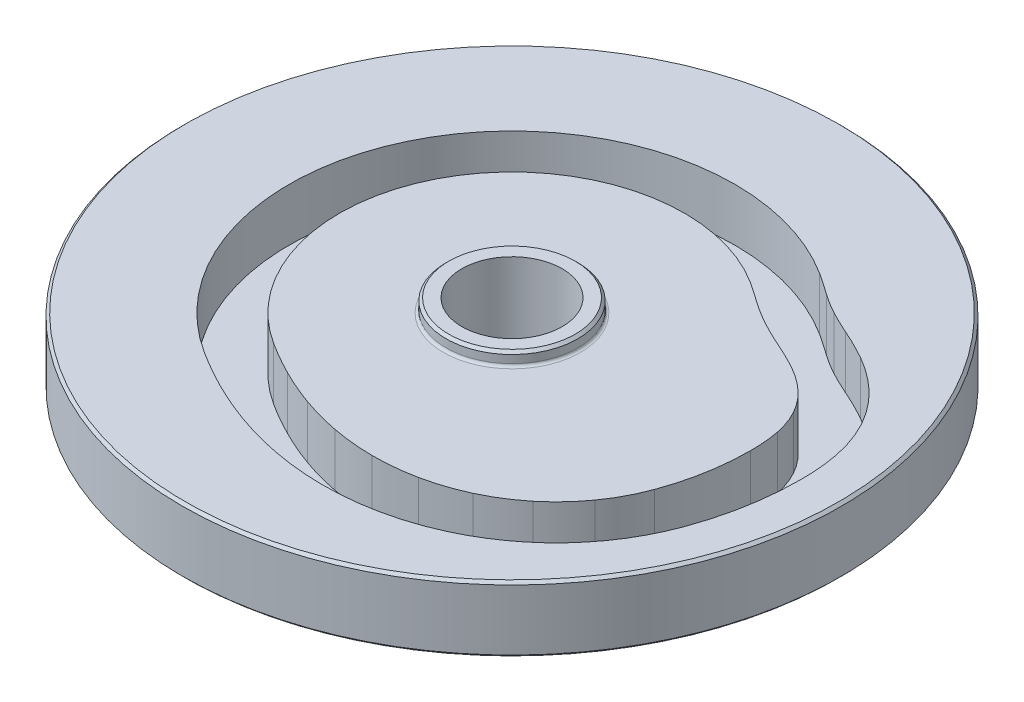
from build123d import *

# Parameters (mm, degrees)
CUT_EXTRUDE_THIN1_DEPTH      = 15
CUT_EXTRUDE_THIN1_DEPTH_BACK = 20


with BuildPart() as part:
    # Sketch1 → Revolve1 (revolve)
    with BuildSketch(Plane.XY, mode=Mode.PRIVATE) as revolve1_sk:
        with BuildLine():
            Line((19.05, 5), (24, 5))
            Line((24, 5), (25, 4))
            Line((25, 4), (25, 1))
            ThreePointArc((25, 1), (25.292893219, 0.292893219), (26, 0))
            Line((26, 0), (124, 0))
            Line((124, 0), (125, -1))
            Line((125, -1), (125, -24))
            Line((125, -24), (124, -25))
            Line((124, -25), (26, -25))
            ThreePointArc((26, -25), (25.292893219, -25.292893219), (25, -26))
            Line((25, -26), (25, -29))
            Line((25, -29), (24, -30))
            Line((24, -30), (19.05, -30))
            Line((19.05, -30), (19.05, 5))
        make_face()
    revolve(revolve1_sk.sketch.rotate(Axis((0, -30350, 0), (0, 1, 0)), 90), axis=Axis((0, -30350, 0), (0, 1, 0)))

    # Sketch2 → Cut-Extrude-Thin1 (cut, two sides: drawn at the far end of the back side and taken through both)
    with BuildSketch(Plane(origin=(0, 0, 0), x_dir=(1, 0, 0), z_dir=(0, 1, 0)).offset(-CUT_EXTRUDE_THIN1_DEPTH_BACK)):
        with BuildLine():
            ThreePointArc((109.524986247, -0.054887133), (109.229921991, 7.423375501), (108.184717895, 14.834112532))
            ThreePointArc((108.184717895, 14.834112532), (106.043659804, 22.548927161), (102.756924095, 29.84960267))
            ThreePointArc((102.756924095, 29.84960267), (98.332860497, 36.567183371), (92.916011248, 42.513272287))
            ThreePointArc((92.916011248, 42.513272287), (87.141221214, 47.295885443), (80.843977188, 51.366058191))
            ThreePointArc((80.843977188, 51.366058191), (75.279655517, 54.316272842), (69.579158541, 56.993916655))
            ThreePointArc((69.579158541, 56.993916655), (65.230785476, 58.999236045), (60.953055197, 61.151137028))
            ThreePointArc((60.953055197, 61.151137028), (57.290135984, 63.276226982), (53.749285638, 65.599019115))
            ThreePointArc((53.749285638, 65.599019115), (49.601954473, 68.481518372), (45.406369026, 71.293318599))
            ThreePointArc((45.406369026, 71.293318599), (-71.312570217, 45.376127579), (-45.345877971, -71.331809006))
            ThreePointArc((-45.345877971, -71.331809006), (-38.593898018, -75.405527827), (-31.649923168, -79.142589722))
            ThreePointArc((-31.649923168, -79.142589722), (-24.034421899, -82.711545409), (-16.211151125, -85.798572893))
            ThreePointArc((-16.211151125, -85.798572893), (-7.620932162, -88.510877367), (1.153325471, -90.550696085))
            ThreePointArc((1.153325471, -90.550696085), (10.620649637, -91.921398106), (20.173660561, -92.420430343))
            ThreePointArc((20.173660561, -92.420430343), (30.195991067, -91.960061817), (40.115734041, -90.457481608))
            ThreePointArc((40.115734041, -90.457481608), (50.164053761, -87.778443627), (59.835395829, -83.955994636))
            ThreePointArc((59.835395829, -83.955994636), (69.217053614, -78.865285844), (77.888616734, -72.641556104))
            ThreePointArc((77.888616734, -72.641556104), (85.826699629, -65.22323814), (92.717665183, -56.823286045))
            ThreePointArc((92.717665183, -56.823286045), (98.476591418, -47.488521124), (102.919592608, -37.460420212))
            ThreePointArc((102.919592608, -37.460420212), (107.856238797, -19.046190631), (109.524986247, -0.054887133))
        make_face()
        with BuildLine():
            ThreePointArc((90.474982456, 0.056342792), (90.262741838, 5.647173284), (89.486847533, 11.187969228))
            ThreePointArc((89.486847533, 11.187969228), (88.12991005, 16.068178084), (86.054133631, 20.688661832))
            ThreePointArc((86.054133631, 20.688661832), (83.284958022, 24.885433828), (79.899946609, 28.603353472))
            ThreePointArc((79.899946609, 28.603353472), (75.875178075, 31.93428485), (71.488414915, 34.771567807))
            ThreePointArc((71.488414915, 34.771567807), (66.751022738, 37.282035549), (61.898062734, 39.56109503))
            ThreePointArc((61.898062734, 39.56109503), (56.897401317, 41.868517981), (51.979131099, 44.346709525))
            ThreePointArc((51.979131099, 44.346709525), (47.310945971, 47.049113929), (42.801511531, 50.008834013))
            ThreePointArc((42.801511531, 50.008834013), (38.952515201, 52.685804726), (35.059073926, 55.297712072))
            ThreePointArc((35.059073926, 55.297712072), (-55.279422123, 35.087905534), (-35.1167276, -55.261117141))
            ThreePointArc((-35.1167276, -55.261117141), (-29.160317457, -58.855298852), (-23.034341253, -62.152173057))
            ThreePointArc((-23.034341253, -62.152173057), (-16.494338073, -65.217270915), (-9.775872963, -67.868439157))
            ThreePointArc((-9.775872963, -67.868439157), (-2.592647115, -70.136469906), (4.744453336, -71.842240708))
            ThreePointArc((4.744453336, -71.842240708), (12.484550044, -72.962801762), (20.294689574, -73.370814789))
            ThreePointArc((20.294689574, -73.370814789), (28.32982468, -73.001688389), (36.282721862, -71.797081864))
            ThreePointArc((36.282721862, -71.797081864), (44.198795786, -69.686506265), (51.817937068, -66.675286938))
            ThreePointArc((51.817937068, -66.675286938), (59.100153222, -62.723698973), (65.831324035, -57.892854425))
            ThreePointArc((65.831324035, -57.892854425), (71.928664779, -52.194534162), (77.221947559, -45.742435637))
            ThreePointArc((77.221947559, -45.742435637), (81.623193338, -38.607897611), (85.018936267, -30.943595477))
            ThreePointArc((85.018936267, -30.943595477), (89.105431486, -15.682719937), (90.474982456, 0.056342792))
        make_face(mode=Mode.SUBTRACT)
    extrude(amount=CUT_EXTRUDE_THIN1_DEPTH + CUT_EXTRUDE_THIN1_DEPTH_BACK, mode=Mode.SUBTRACT)


solid = part.part
